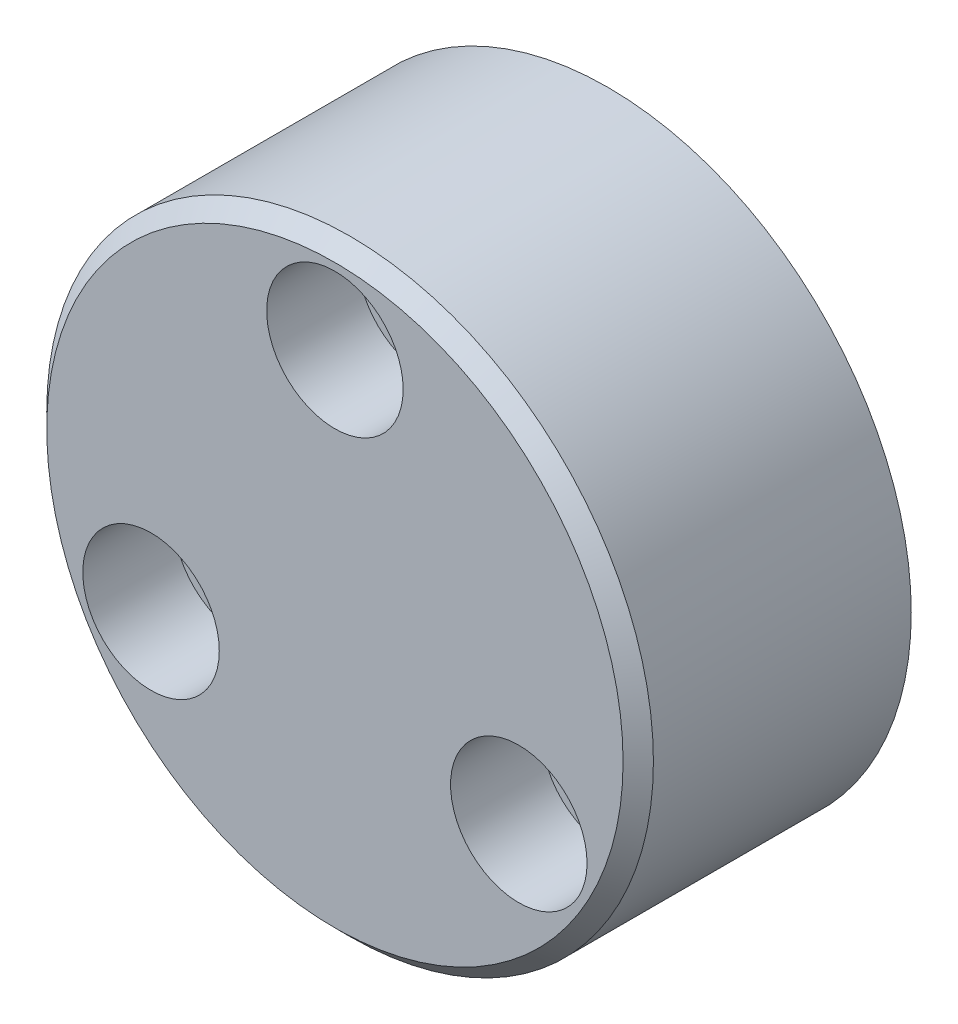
from build123d import *

# Parameters (mm, degrees)
ESQUISSE1_R                       = 20
ESQUISSE1_R_2                     = 2.75
EXTRUSION1_DEPTH                  = 18
CHANFREIN1_SIZE                   = 1
ESQUISSE2_R                       = 4.5
ENL_V_MAT_EXTRU_1_DEPTH           = 6
DIAM_TRE_DU_PER_AGE_8_0_8_1_D     = 8
DIAM_TRE_DU_PER_AGE_8_0_8_1_DEPTH = 13
DIAM_TRE_DU_PER_AGE_8_0_8_1_TIP   = 2.403442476


with BuildPart() as part:
    # Esquisse1 → Extrusion1 (new body)
    with BuildSketch(Plane.XY):
        Circle(ESQUISSE1_R)
        with Locations((0, 14)):
            Circle(ESQUISSE1_R_2, mode=Mode.SUBTRACT)
        with Locations((12.124355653, -7)):
            Circle(ESQUISSE1_R_2, mode=Mode.SUBTRACT)
        with Locations((-12.124355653, -7)):
            Circle(ESQUISSE1_R_2, mode=Mode.SUBTRACT)
    extrude(amount=EXTRUSION1_DEPTH)

    # Chanfrein1
    chanfrein1_edges = [part.edges().sort_by_distance(p)[0] for p in [
        (-20, 0, 18),
    ]]
    chamfer(chanfrein1_edges, length=CHANFREIN1_SIZE)

    # Esquisse2 → Enl_v. mat.-Extru.1 (cut)
    with BuildSketch(Plane.XY.offset(18)):
        with Locations((0, 14)):
            Circle(ESQUISSE2_R)
        with Locations((-12.124355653, -7)):
            Circle(ESQUISSE2_R)
        with Locations((12.124355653, -7)):
            Circle(ESQUISSE2_R)
    extrude(amount=-ENL_V_MAT_EXTRU_1_DEPTH, mode=Mode.SUBTRACT)

    # Esquisse3 → Enl_vement de mati_re-R_volution1 (revolve, cut)
    with BuildSketch(Plane(origin=(0, 0, 0), x_dir=(0, 0, -1), z_dir=(1, 0, 0))):
        Polygon((-8, 0), (-12, 0), (-12, -4.845299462), (-14, -6), (-14, -21.379995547), (-8, -21.379995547), align=None)
    revolve(axis=Axis((0, 5.714285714, 8), (0, -1, 0)), mode=Mode.SUBTRACT)

    # Diam_tre du per_age _8.0 _8_1
    with Locations(Plane(origin=(0, 0, 0), x_dir=(-1, 0, 0), z_dir=(0, 0, -1))):
        with Locations((0, 0)):
            Hole(DIAM_TRE_DU_PER_AGE_8_0_8_1_D / 2, depth=DIAM_TRE_DU_PER_AGE_8_0_8_1_DEPTH)
            with Locations((0, 0, -(DIAM_TRE_DU_PER_AGE_8_0_8_1_DEPTH + DIAM_TRE_DU_PER_AGE_8_0_8_1_TIP / 2))):  # 118° drill point
                Cone(0, DIAM_TRE_DU_PER_AGE_8_0_8_1_D / 2, DIAM_TRE_DU_PER_AGE_8_0_8_1_TIP, mode=Mode.SUBTRACT)


solid = part.part
